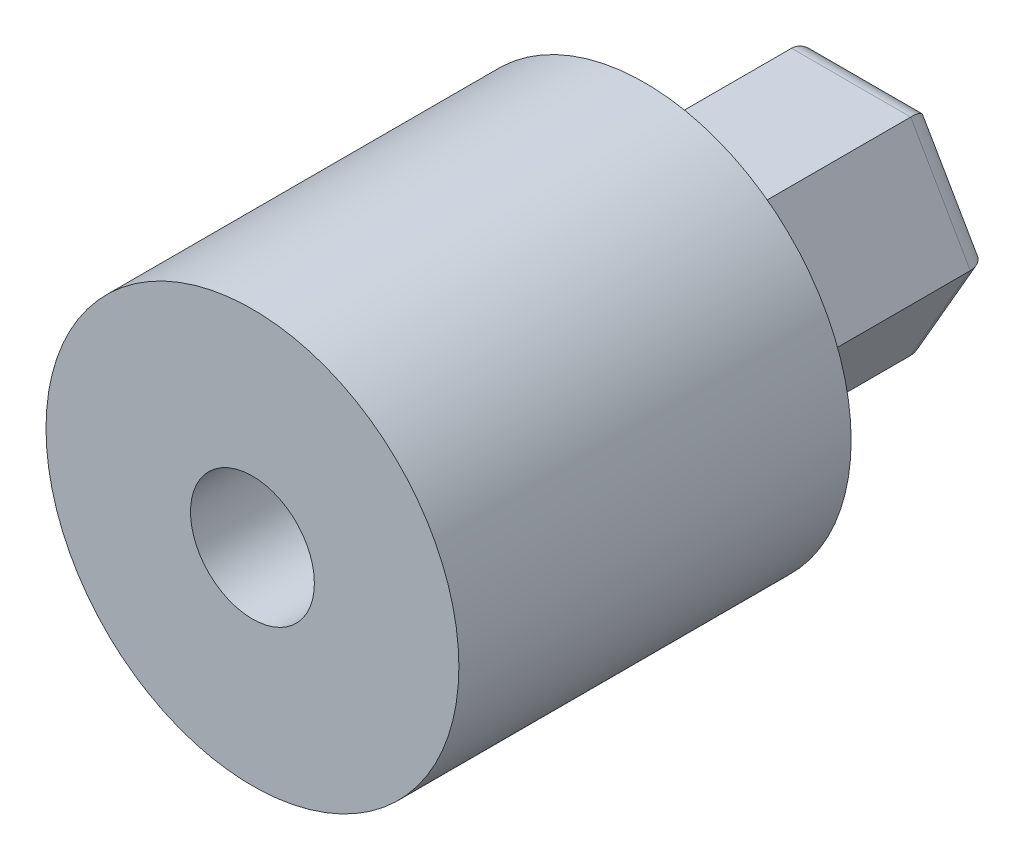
from build123d import *

# Parameters (mm, degrees)
SALIENTE_EXTRUIR1_DEPTH = 15
CROQUIS2_R              = 1.6
CORTAR_EXTRUIR1_DEPTH   = 2
CROQUIS3_R              = 1.5
CORTAR_EXTRUIR2_DEPTH   = 6
REDONDEO1_R             = 0.5
CROQUIS4_R              = 5
CROQUIS4_R_2            = 1.5
SALIENTE_EXTRUIR2_DEPTH = 9.5


with BuildPart() as part:
    # Croquis1 → Saliente-Extruir1 (new body)
    with BuildSketch(Plane.XY):
        Polygon((-1.443375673, 2.5), (-2.886751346, 0), (-1.443375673, -2.5), (1.443375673, -2.5), (2.886751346, 0), (1.443375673, 2.5), align=None)
    extrude(amount=SALIENTE_EXTRUIR1_DEPTH)

    # Croquis2 → Cortar-Extruir1 (cut)
    with BuildSketch(Plane(origin=(0, 0, 0), x_dir=(-1, 0, 0), z_dir=(0, 0, -1))):
        Circle(CROQUIS2_R)
    extrude(amount=-CORTAR_EXTRUIR1_DEPTH, mode=Mode.SUBTRACT)

    # Croquis3 → Cortar-Extruir2 (cut)
    with BuildSketch(Plane.XY.offset(15)):
        Circle(CROQUIS3_R)
    extrude(amount=-CORTAR_EXTRUIR2_DEPTH, mode=Mode.SUBTRACT)

    # Redondeo1
    redondeo1_edges = [part.edges().sort_by_distance(p)[0] for p in [
        (2.165063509, 1.25, 0),
        (2.165063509, -1.25, 0),
        (0, -2.5, 0),
        (-2.165063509, -1.25, 0),
        (-2.165063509, 1.25, 0),
        (0, 2.5, 0),
    ]]
    fillet(redondeo1_edges, radius=REDONDEO1_R)

    # Croquis4 → Saliente-Extruir2 (add)
    with BuildSketch(Plane.XY.offset(15)):
        Circle(CROQUIS4_R)
        Circle(CROQUIS4_R_2, mode=Mode.SUBTRACT)
    extrude(amount=-SALIENTE_EXTRUIR2_DEPTH)


solid = part.part
